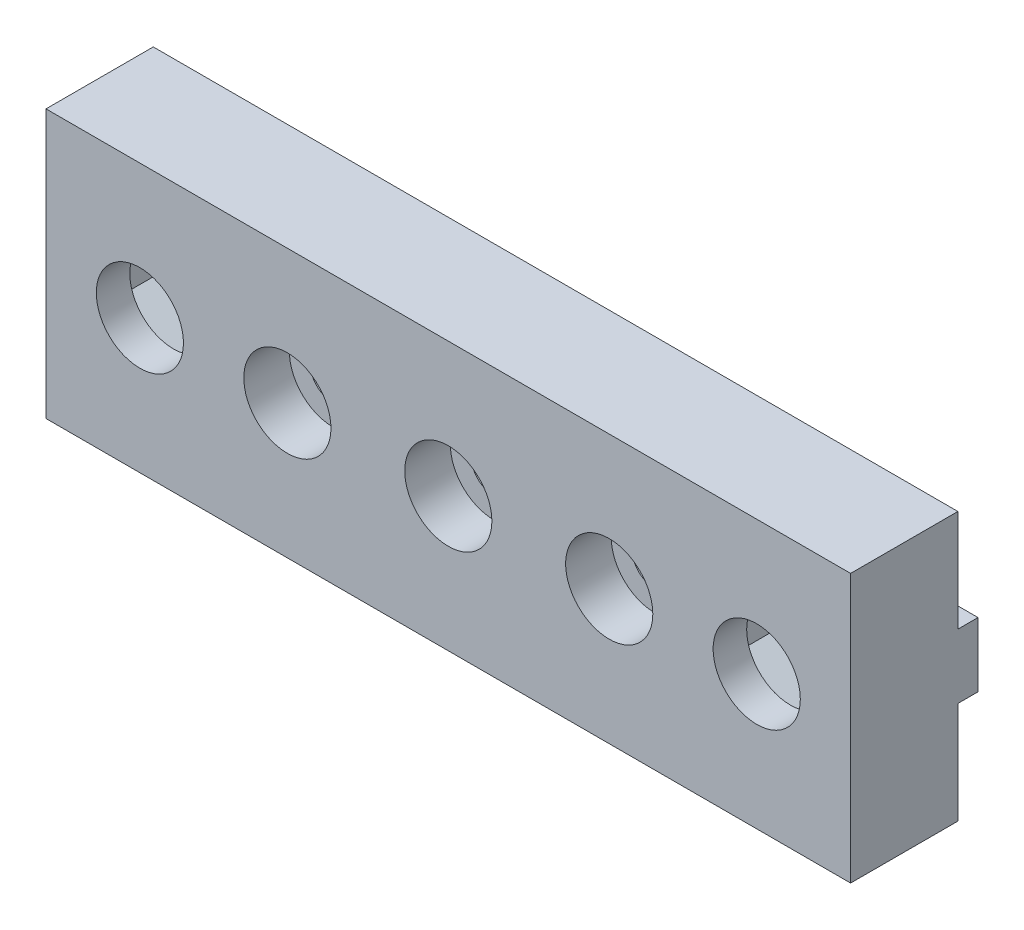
ISO-10303-21;
HEADER;
FILE_DESCRIPTION(('STEP AP214'),'2;1');
FILE_NAME('part.step','',(''),(''),'','','');
FILE_SCHEMA(('AUTOMOTIVE_DESIGN { 1 0 10303 214 1 1 1 1 }'));
ENDSEC;
DATA;
#1=APPLICATION_CONTEXT('core data for automotive mechanical design processes');
#2=APPLICATION_PROTOCOL_DEFINITION('international standard','automotive_design',2000,#1);
#3=PRODUCT_CONTEXT('',#1,'mechanical');
#4=PRODUCT('Part','Part','',(#3));
#5=PRODUCT_RELATED_PRODUCT_CATEGORY('part','',(#4));
#6=PRODUCT_DEFINITION_FORMATION('','',#4);
#7=PRODUCT_DEFINITION_CONTEXT('part definition',#1,'design');
#8=PRODUCT_DEFINITION('design','',#6,#7);
#9=PRODUCT_DEFINITION_SHAPE('','',#8);
#10=(LENGTH_UNIT() NAMED_UNIT(*) SI_UNIT(.MILLI.,.METRE.));
#11=(NAMED_UNIT(*) PLANE_ANGLE_UNIT() SI_UNIT($,.RADIAN.));
#12=(NAMED_UNIT(*) SI_UNIT($,.STERADIAN.) SOLID_ANGLE_UNIT());
#13=UNCERTAINTY_MEASURE_WITH_UNIT(LENGTH_MEASURE(1.E-05),#10,'distance_accuracy_value','');
#14=(GEOMETRIC_REPRESENTATION_CONTEXT(3) GLOBAL_UNCERTAINTY_ASSIGNED_CONTEXT((#13)) GLOBAL_UNIT_ASSIGNED_CONTEXT((#10,
#11,#12)) REPRESENTATION_CONTEXT('',''));
#15=CARTESIAN_POINT('',(0.,0.,0.));
#16=DIRECTION('',(0.,0.,1.));
#17=DIRECTION('',(1.,0.,0.));
#18=AXIS2_PLACEMENT_3D('',#15,#16,#17);
#19=CARTESIAN_POINT('',(30.,-2.4,-5.5));
#20=DIRECTION('',(0.,1.,0.));
#21=DIRECTION('',(0.,0.,1.));
#22=AXIS2_PLACEMENT_3D('',#19,#20,#21);
#23=PLANE('',#22);
#24=DIRECTION('',(0.,0.,-1.));
#25=VECTOR('',#24,1.);
#26=CARTESIAN_POINT('',(-28.1,-2.4,-5.5));
#27=LINE('',#26,#25);
#28=CARTESIAN_POINT('',(-28.1,-2.4,-4.));
#29=VERTEX_POINT('',#28);
#30=CARTESIAN_POINT('',(-28.1,-2.4,-5.5));
#31=VERTEX_POINT('',#30);
#32=EDGE_CURVE('E381',#29,#31,#27,.T.);
#33=ORIENTED_EDGE('',*,*,#32,.F.);
#34=DIRECTION('',(1.,0.,0.));
#35=VECTOR('',#34,1.);
#36=CARTESIAN_POINT('',(0.,-2.4,-4.));
#37=LINE('',#36,#35);
#38=CARTESIAN_POINT('',(-30.,-2.4,-4.));
#39=VERTEX_POINT('',#38);
#40=EDGE_CURVE('E493',#39,#29,#37,.T.);
#41=ORIENTED_EDGE('',*,*,#40,.F.);
#42=DIRECTION('',(0.,0.,1.));
#43=VECTOR('',#42,1.);
#44=CARTESIAN_POINT('',(-30.,-2.4,-5.5));
#45=LINE('',#44,#43);
#46=CARTESIAN_POINT('',(-30.,-2.4,-5.5));
#47=VERTEX_POINT('',#46);
#48=EDGE_CURVE('E430',#47,#39,#45,.T.);
#49=ORIENTED_EDGE('',*,*,#48,.F.);
#50=DIRECTION('',(-1.,0.,0.));
#51=VECTOR('',#50,1.);
#52=CARTESIAN_POINT('',(30.,-2.4,-5.5));
#53=LINE('',#52,#51);
#54=EDGE_CURVE('E425',#31,#47,#53,.T.);
#55=ORIENTED_EDGE('',*,*,#54,.F.);
#56=EDGE_LOOP('',(#33,#41,#49,#55));
#57=FACE_BOUND('',#56,.T.);
#58=ADVANCED_FACE('F45',(#57),#23,.F.);
#59=CARTESIAN_POINT('',(0.,0.,-5.5));
#60=DIRECTION('',(0.,0.,1.));
#61=DIRECTION('',(1.,0.,0.));
#62=AXIS2_PLACEMENT_3D('',#59,#60,#61);
#63=PLANE('',#62);
#64=DIRECTION('',(0.,1.,0.));
#65=VECTOR('',#64,1.);
#66=CARTESIAN_POINT('',(-28.1,-2.94448637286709,-5.5));
#67=LINE('',#66,#65);
#68=CARTESIAN_POINT('',(-28.1,2.4,-5.5));
#69=VERTEX_POINT('',#68);
#70=EDGE_CURVE('E64',#31,#69,#67,.T.);
#71=ORIENTED_EDGE('',*,*,#70,.F.);
#72=ORIENTED_EDGE('',*,*,#54,.T.);
#73=DIRECTION('',(0.,1.,0.));
#74=VECTOR('',#73,1.);
#75=CARTESIAN_POINT('',(-30.,-2.4,-5.5));
#76=LINE('',#75,#74);
#77=CARTESIAN_POINT('',(-30.,2.4,-5.5));
#78=VERTEX_POINT('',#77);
#79=EDGE_CURVE('E412',#47,#78,#76,.T.);
#80=ORIENTED_EDGE('',*,*,#79,.T.);
#81=DIRECTION('',(1.,0.,0.));
#82=VECTOR('',#81,1.);
#83=CARTESIAN_POINT('',(30.,2.4,-5.5));
#84=LINE('',#83,#82);
#85=EDGE_CURVE('E417',#78,#69,#84,.T.);
#86=ORIENTED_EDGE('',*,*,#85,.T.);
#87=EDGE_LOOP('',(#71,#72,#80,#86));
#88=FACE_BOUND('',#87,.T.);
#89=ADVANCED_FACE('F740',(#88),#63,.F.);
#90=CARTESIAN_POINT('',(30.,2.4,-5.5));
#91=DIRECTION('',(0.,-1.,0.));
#92=DIRECTION('',(0.,0.,-1.));
#93=AXIS2_PLACEMENT_3D('',#90,#91,#92);
#94=PLANE('',#93);
#95=DIRECTION('',(0.,0.,1.));
#96=VECTOR('',#95,1.);
#97=CARTESIAN_POINT('',(17.9,2.4,-5.5));
#98=LINE('',#97,#96);
#99=CARTESIAN_POINT('',(17.9,2.4,-5.5));
#100=VERTEX_POINT('',#99);
#101=CARTESIAN_POINT('',(17.9,2.4,-4.));
#102=VERTEX_POINT('',#101);
#103=EDGE_CURVE('E401',#100,#102,#98,.T.);
#104=ORIENTED_EDGE('',*,*,#103,.F.);
#105=CARTESIAN_POINT('',(-17.9,2.4,-5.5));
#106=VERTEX_POINT('',#105);
#107=EDGE_CURVE('E422',#106,#100,#84,.T.);
#108=ORIENTED_EDGE('',*,*,#107,.F.);
#109=DIRECTION('',(0.,0.,-1.));
#110=VECTOR('',#109,1.);
#111=CARTESIAN_POINT('',(-17.9,2.4,-5.5));
#112=LINE('',#111,#110);
#113=CARTESIAN_POINT('',(-17.9,2.4,-4.));
#114=VERTEX_POINT('',#113);
#115=EDGE_CURVE('E391',#114,#106,#112,.T.);
#116=ORIENTED_EDGE('',*,*,#115,.F.);
#117=DIRECTION('',(-1.,0.,0.));
#118=VECTOR('',#117,1.);
#119=CARTESIAN_POINT('',(0.,2.4,-4.));
#120=LINE('',#119,#118);
#121=EDGE_CURVE('E504',#102,#114,#120,.T.);
#122=ORIENTED_EDGE('',*,*,#121,.F.);
#123=EDGE_LOOP('',(#104,#108,#116,#122));
#124=FACE_BOUND('',#123,.T.);
#125=ADVANCED_FACE('F694',(#124),#94,.F.);
#126=DIRECTION('',(0.,0.,-1.));
#127=VECTOR('',#126,1.);
#128=CARTESIAN_POINT('',(17.9,-2.4,-5.5));
#129=LINE('',#128,#127);
#130=CARTESIAN_POINT('',(17.9,-2.4,-4.));
#131=VERTEX_POINT('',#130);
#132=CARTESIAN_POINT('',(17.9,-2.4,-5.5));
#133=VERTEX_POINT('',#132);
#134=EDGE_CURVE('E394',#131,#133,#129,.T.);
#135=ORIENTED_EDGE('',*,*,#134,.F.);
#136=CARTESIAN_POINT('',(-17.9,-2.4,-4.));
#137=VERTEX_POINT('',#136);
#138=EDGE_CURVE('E498',#137,#131,#37,.T.);
#139=ORIENTED_EDGE('',*,*,#138,.F.);
#140=DIRECTION('',(0.,0.,1.));
#141=VECTOR('',#140,1.);
#142=CARTESIAN_POINT('',(-17.9,-2.4,-5.5));
#143=LINE('',#142,#141);
#144=CARTESIAN_POINT('',(-17.9,-2.4,-5.5));
#145=VERTEX_POINT('',#144);
#146=EDGE_CURVE('E384',#145,#137,#143,.T.);
#147=ORIENTED_EDGE('',*,*,#146,.F.);
#148=EDGE_CURVE('E431',#133,#145,#53,.T.);
#149=ORIENTED_EDGE('',*,*,#148,.F.);
#150=EDGE_LOOP('',(#135,#139,#147,#149));
#151=FACE_BOUND('',#150,.T.);
#152=ADVANCED_FACE('F704',(#151),#23,.F.);
#153=CARTESIAN_POINT('',(-12.,0.,-5.5));
#154=DIRECTION('',(0.,0.,1.));
#155=DIRECTION('',(1.,0.,0.));
#156=AXIS2_PLACEMENT_3D('',#153,#154,#155);
#157=CIRCLE('',#156,1.7);
#158=CARTESIAN_POINT('',(-10.3,0.,-5.5));
#159=VERTEX_POINT('',#158);
#160=EDGE_CURVE('E1219',#159,#159,#157,.T.);
#161=ORIENTED_EDGE('',*,*,#160,.T.);
#162=EDGE_LOOP('',(#161));
#163=FACE_BOUND('',#162,.T.);
#164=CARTESIAN_POINT('',(0.,0.,-5.5));
#165=DIRECTION('',(0.,0.,1.));
#166=DIRECTION('',(1.,0.,0.));
#167=AXIS2_PLACEMENT_3D('',#164,#165,#166);
#168=CIRCLE('',#167,1.7);
#169=CARTESIAN_POINT('',(1.7,0.,-5.5));
#170=VERTEX_POINT('',#169);
#171=EDGE_CURVE('E1233',#170,#170,#168,.T.);
#172=ORIENTED_EDGE('',*,*,#171,.T.);
#173=EDGE_LOOP('',(#172));
#174=FACE_BOUND('',#173,.T.);
#175=CARTESIAN_POINT('',(12.,0.,-5.5));
#176=DIRECTION('',(0.,0.,1.));
#177=DIRECTION('',(1.,0.,0.));
#178=AXIS2_PLACEMENT_3D('',#175,#176,#177);
#179=CIRCLE('',#178,1.7);
#180=CARTESIAN_POINT('',(13.7,0.,-5.5));
#181=VERTEX_POINT('',#180);
#182=EDGE_CURVE('E282',#181,#181,#179,.T.);
#183=ORIENTED_EDGE('',*,*,#182,.T.);
#184=EDGE_LOOP('',(#183));
#185=FACE_BOUND('',#184,.T.);
#186=DIRECTION('',(0.,1.,0.));
#187=VECTOR('',#186,1.);
#188=CARTESIAN_POINT('',(17.9,-2.9444863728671,-5.5));
#189=LINE('',#188,#187);
#190=EDGE_CURVE('E299',#133,#100,#189,.T.);
#191=ORIENTED_EDGE('',*,*,#190,.F.);
#192=ORIENTED_EDGE('',*,*,#148,.T.);
#193=DIRECTION('',(0.,-1.,0.));
#194=VECTOR('',#193,1.);
#195=CARTESIAN_POINT('',(-17.9,2.94448637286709,-5.5));
#196=LINE('',#195,#194);
#197=EDGE_CURVE('E340',#106,#145,#196,.T.);
#198=ORIENTED_EDGE('',*,*,#197,.F.);
#199=ORIENTED_EDGE('',*,*,#107,.T.);
#200=EDGE_LOOP('',(#191,#192,#198,#199));
#201=FACE_BOUND('',#200,.T.);
#202=ADVANCED_FACE('F702',(#163,#174,#185,#201),#63,.F.);
#203=DIRECTION('',(0.,0.,-1.));
#204=VECTOR('',#203,1.);
#205=CARTESIAN_POINT('',(28.1,2.4,-5.5));
#206=LINE('',#205,#204);
#207=CARTESIAN_POINT('',(28.1,2.4,-4.));
#208=VERTEX_POINT('',#207);
#209=CARTESIAN_POINT('',(28.1,2.4,-5.5));
#210=VERTEX_POINT('',#209);
#211=EDGE_CURVE('E72',#208,#210,#206,.T.);
#212=ORIENTED_EDGE('',*,*,#211,.F.);
#213=CARTESIAN_POINT('',(30.,2.4,-4.));
#214=VERTEX_POINT('',#213);
#215=EDGE_CURVE('E499',#214,#208,#120,.T.);
#216=ORIENTED_EDGE('',*,*,#215,.F.);
#217=DIRECTION('',(0.,0.,1.));
#218=VECTOR('',#217,1.);
#219=CARTESIAN_POINT('',(30.,2.4,-5.5));
#220=LINE('',#219,#218);
#221=CARTESIAN_POINT('',(30.,2.4,-5.5));
#222=VERTEX_POINT('',#221);
#223=EDGE_CURVE('E439',#222,#214,#220,.T.);
#224=ORIENTED_EDGE('',*,*,#223,.F.);
#225=EDGE_CURVE('E416',#210,#222,#84,.T.);
#226=ORIENTED_EDGE('',*,*,#225,.F.);
#227=EDGE_LOOP('',(#212,#216,#224,#226));
#228=FACE_BOUND('',#227,.T.);
#229=ADVANCED_FACE('F760',(#228),#94,.F.);
#230=CARTESIAN_POINT('',(0.,0.,-4.));
#231=DIRECTION('',(0.,0.,-1.));
#232=DIRECTION('',(-1.,0.,0.));
#233=AXIS2_PLACEMENT_3D('',#230,#231,#232);
#234=PLANE('',#233);
#235=ORIENTED_EDGE('',*,*,#215,.T.);
#236=DIRECTION('',(0.,1.,0.));
#237=VECTOR('',#236,1.);
#238=CARTESIAN_POINT('',(28.1,0.,-4.));
#239=LINE('',#238,#237);
#240=CARTESIAN_POINT('',(28.1,2.9444863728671,-4.));
#241=VERTEX_POINT('',#240);
#242=EDGE_CURVE('E367',#208,#241,#239,.T.);
#243=ORIENTED_EDGE('',*,*,#242,.T.);
#244=DIRECTION('',(-0.866025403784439,0.5,0.));
#245=VECTOR('',#244,1.);
#246=CARTESIAN_POINT('',(8.29999999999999,14.3760217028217,-4.));
#247=LINE('',#246,#245);
#248=CARTESIAN_POINT('',(23.,5.88897274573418,-4.));
#249=VERTEX_POINT('',#248);
#250=EDGE_CURVE('E11',#241,#249,#247,.T.);
#251=ORIENTED_EDGE('',*,*,#250,.T.);
#252=DIRECTION('',(-0.866025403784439,-0.5,0.));
#253=VECTOR('',#252,1.);
#254=CARTESIAN_POINT('',(3.2,-5.54256258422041,-4.));
#255=LINE('',#254,#253);
#256=CARTESIAN_POINT('',(17.9,2.94448637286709,-4.));
#257=VERTEX_POINT('',#256);
#258=EDGE_CURVE('E54',#249,#257,#255,.T.);
#259=ORIENTED_EDGE('',*,*,#258,.T.);
#260=DIRECTION('',(0.,-1.,0.));
#261=VECTOR('',#260,1.);
#262=CARTESIAN_POINT('',(17.9,0.,-4.));
#263=LINE('',#262,#261);
#264=EDGE_CURVE('E397',#257,#102,#263,.T.);
#265=ORIENTED_EDGE('',*,*,#264,.T.);
#266=ORIENTED_EDGE('',*,*,#121,.T.);
#267=DIRECTION('',(0.,1.,0.));
#268=VECTOR('',#267,1.);
#269=CARTESIAN_POINT('',(-17.9,0.,-4.));
#270=LINE('',#269,#268);
#271=CARTESIAN_POINT('',(-17.9,2.94448637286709,-4.));
#272=VERTEX_POINT('',#271);
#273=EDGE_CURVE('E387',#114,#272,#270,.T.);
#274=ORIENTED_EDGE('',*,*,#273,.T.);
#275=DIRECTION('',(-0.866025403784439,0.5,0.));
#276=VECTOR('',#275,1.);
#277=CARTESIAN_POINT('',(-3.2,-5.5425625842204,-4.));
#278=LINE('',#277,#276);
#279=CARTESIAN_POINT('',(-23.,5.88897274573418,-4.));
#280=VERTEX_POINT('',#279);
#281=EDGE_CURVE('E541',#272,#280,#278,.T.);
#282=ORIENTED_EDGE('',*,*,#281,.T.);
#283=DIRECTION('',(-0.866025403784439,-0.5,0.));
#284=VECTOR('',#283,1.);
#285=CARTESIAN_POINT('',(-8.29999999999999,14.3760217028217,-4.));
#286=LINE('',#285,#284);
#287=CARTESIAN_POINT('',(-28.1,2.94448637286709,-4.));
#288=VERTEX_POINT('',#287);
#289=EDGE_CURVE('E537',#280,#288,#286,.T.);
#290=ORIENTED_EDGE('',*,*,#289,.T.);
#291=DIRECTION('',(0.,-1.,0.));
#292=VECTOR('',#291,1.);
#293=CARTESIAN_POINT('',(-28.1,0.,-4.));
#294=LINE('',#293,#292);
#295=CARTESIAN_POINT('',(-28.1,2.4,-4.));
#296=VERTEX_POINT('',#295);
#297=EDGE_CURVE('E373',#288,#296,#294,.T.);
#298=ORIENTED_EDGE('',*,*,#297,.T.);
#299=CARTESIAN_POINT('',(-30.,2.4,-4.));
#300=VERTEX_POINT('',#299);
#301=EDGE_CURVE('E497',#296,#300,#120,.T.);
#302=ORIENTED_EDGE('',*,*,#301,.T.);
#303=DIRECTION('',(0.,-1.,0.));
#304=VECTOR('',#303,1.);
#305=CARTESIAN_POINT('',(-30.,-10.,-4.));
#306=LINE('',#305,#304);
#307=CARTESIAN_POINT('',(-30.,10.,-4.));
#308=VERTEX_POINT('',#307);
#309=EDGE_CURVE('E471',#308,#300,#306,.T.);
#310=ORIENTED_EDGE('',*,*,#309,.F.);
#311=DIRECTION('',(-1.,0.,0.));
#312=VECTOR('',#311,1.);
#313=CARTESIAN_POINT('',(-30.,10.,-4.));
#314=LINE('',#313,#312);
#315=CARTESIAN_POINT('',(30.,10.,-4.));
#316=VERTEX_POINT('',#315);
#317=EDGE_CURVE('E467',#316,#308,#314,.T.);
#318=ORIENTED_EDGE('',*,*,#317,.F.);
#319=DIRECTION('',(0.,1.,0.));
#320=VECTOR('',#319,1.);
#321=CARTESIAN_POINT('',(30.,-10.,-4.));
#322=LINE('',#321,#320);
#323=EDGE_CURVE('E447',#214,#316,#322,.T.);
#324=ORIENTED_EDGE('',*,*,#323,.F.);
#325=EDGE_LOOP('',(#235,#243,#251,#259,#265,#266,#274,#282,#290,#298,#302,#310,#318,#324));
#326=FACE_BOUND('',#325,.T.);
#327=ADVANCED_FACE('F547',(#326),#234,.T.);
#328=DIRECTION('',(0.866025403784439,0.5,0.));
#329=VECTOR('',#328,1.);
#330=CARTESIAN_POINT('',(8.3,-14.3760217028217,-4.));
#331=LINE('',#330,#329);
#332=CARTESIAN_POINT('',(23.,-5.88897274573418,-4.));
#333=VERTEX_POINT('',#332);
#334=CARTESIAN_POINT('',(28.1,-2.94448637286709,-4.));
#335=VERTEX_POINT('',#334);
#336=EDGE_CURVE('E533',#333,#335,#331,.T.);
#337=ORIENTED_EDGE('',*,*,#336,.T.);
#338=DIRECTION('',(0.,1.,0.));
#339=VECTOR('',#338,1.);
#340=CARTESIAN_POINT('',(28.1,0.,-4.));
#341=LINE('',#340,#339);
#342=CARTESIAN_POINT('',(28.1,-2.4,-4.));
#343=VERTEX_POINT('',#342);
#344=EDGE_CURVE('E362',#335,#343,#341,.T.);
#345=ORIENTED_EDGE('',*,*,#344,.T.);
#346=CARTESIAN_POINT('',(30.,-2.4,-4.));
#347=VERTEX_POINT('',#346);
#348=EDGE_CURVE('E492',#343,#347,#37,.T.);
#349=ORIENTED_EDGE('',*,*,#348,.T.);
#350=CARTESIAN_POINT('',(30.,-10.,-4.));
#351=VERTEX_POINT('',#350);
#352=EDGE_CURVE('E463',#351,#347,#322,.T.);
#353=ORIENTED_EDGE('',*,*,#352,.F.);
#354=DIRECTION('',(1.,0.,0.));
#355=VECTOR('',#354,1.);
#356=CARTESIAN_POINT('',(-30.,-10.,-4.));
#357=LINE('',#356,#355);
#358=CARTESIAN_POINT('',(-30.,-10.,-4.));
#359=VERTEX_POINT('',#358);
#360=EDGE_CURVE('E453',#359,#351,#357,.T.);
#361=ORIENTED_EDGE('',*,*,#360,.F.);
#362=EDGE_CURVE('E470',#39,#359,#306,.T.);
#363=ORIENTED_EDGE('',*,*,#362,.F.);
#364=ORIENTED_EDGE('',*,*,#40,.T.);
#365=DIRECTION('',(0.,-1.,0.));
#366=VECTOR('',#365,1.);
#367=CARTESIAN_POINT('',(-28.1,0.,-4.));
#368=LINE('',#367,#366);
#369=CARTESIAN_POINT('',(-28.1,-2.94448637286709,-4.));
#370=VERTEX_POINT('',#369);
#371=EDGE_CURVE('E377',#29,#370,#368,.T.);
#372=ORIENTED_EDGE('',*,*,#371,.T.);
#373=DIRECTION('',(0.866025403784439,-0.5,0.));
#374=VECTOR('',#373,1.);
#375=CARTESIAN_POINT('',(-8.3,-14.3760217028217,-4.));
#376=LINE('',#375,#374);
#377=CARTESIAN_POINT('',(-23.,-5.88897274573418,-4.));
#378=VERTEX_POINT('',#377);
#379=EDGE_CURVE('E513',#370,#378,#376,.T.);
#380=ORIENTED_EDGE('',*,*,#379,.T.);
#381=DIRECTION('',(0.866025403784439,0.5,0.));
#382=VECTOR('',#381,1.);
#383=CARTESIAN_POINT('',(-3.2,5.5425625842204,-4.));
#384=LINE('',#383,#382);
#385=CARTESIAN_POINT('',(-17.9,-2.94448637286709,-4.));
#386=VERTEX_POINT('',#385);
#387=EDGE_CURVE('E517',#378,#386,#384,.T.);
#388=ORIENTED_EDGE('',*,*,#387,.T.);
#389=DIRECTION('',(0.,1.,0.));
#390=VECTOR('',#389,1.);
#391=CARTESIAN_POINT('',(-17.9,0.,-4.));
#392=LINE('',#391,#390);
#393=EDGE_CURVE('E521',#386,#137,#392,.T.);
#394=ORIENTED_EDGE('',*,*,#393,.T.);
#395=ORIENTED_EDGE('',*,*,#138,.T.);
#396=DIRECTION('',(0.,-1.,0.));
#397=VECTOR('',#396,1.);
#398=CARTESIAN_POINT('',(17.9,0.,-4.));
#399=LINE('',#398,#397);
#400=CARTESIAN_POINT('',(17.9,-2.9444863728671,-4.));
#401=VERTEX_POINT('',#400);
#402=EDGE_CURVE('E525',#131,#401,#399,.T.);
#403=ORIENTED_EDGE('',*,*,#402,.T.);
#404=DIRECTION('',(0.866025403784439,-0.5,0.));
#405=VECTOR('',#404,1.);
#406=CARTESIAN_POINT('',(3.2,5.5425625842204,-4.));
#407=LINE('',#406,#405);
#408=EDGE_CURVE('E529',#401,#333,#407,.T.);
#409=ORIENTED_EDGE('',*,*,#408,.T.);
#410=EDGE_LOOP('',(#337,#345,#349,#353,#361,#363,#364,#372,#380,#388,#394,#395,#403,#409));
#411=FACE_BOUND('',#410,.T.);
#412=ADVANCED_FACE('F565',(#411),#234,.T.);
#413=DIRECTION('',(0.,0.,1.));
#414=VECTOR('',#413,1.);
#415=CARTESIAN_POINT('',(-28.1,2.4,-5.5));
#416=LINE('',#415,#414);
#417=EDGE_CURVE('E503',#69,#296,#416,.T.);
#418=ORIENTED_EDGE('',*,*,#417,.F.);
#419=ORIENTED_EDGE('',*,*,#85,.F.);
#420=DIRECTION('',(0.,0.,1.));
#421=VECTOR('',#420,1.);
#422=CARTESIAN_POINT('',(-30.,2.4,-5.5));
#423=LINE('',#422,#421);
#424=EDGE_CURVE('E443',#78,#300,#423,.T.);
#425=ORIENTED_EDGE('',*,*,#424,.T.);
#426=ORIENTED_EDGE('',*,*,#301,.F.);
#427=EDGE_LOOP('',(#418,#419,#425,#426));
#428=FACE_BOUND('',#427,.T.);
#429=ADVANCED_FACE('F752',(#428),#94,.F.);
#430=DIRECTION('',(0.,0.,1.));
#431=VECTOR('',#430,1.);
#432=CARTESIAN_POINT('',(28.1,-2.4,-5.5));
#433=LINE('',#432,#431);
#434=CARTESIAN_POINT('',(28.1,-2.4,-5.5));
#435=VERTEX_POINT('',#434);
#436=EDGE_CURVE('E359',#435,#343,#433,.T.);
#437=ORIENTED_EDGE('',*,*,#436,.F.);
#438=CARTESIAN_POINT('',(30.,-2.4,-5.5));
#439=VERTEX_POINT('',#438);
#440=EDGE_CURVE('E426',#439,#435,#53,.T.);
#441=ORIENTED_EDGE('',*,*,#440,.F.);
#442=DIRECTION('',(0.,0.,1.));
#443=VECTOR('',#442,1.);
#444=CARTESIAN_POINT('',(30.,-2.4,-5.5));
#445=LINE('',#444,#443);
#446=EDGE_CURVE('E435',#439,#347,#445,.T.);
#447=ORIENTED_EDGE('',*,*,#446,.T.);
#448=ORIENTED_EDGE('',*,*,#348,.F.);
#449=EDGE_LOOP('',(#437,#441,#447,#448));
#450=FACE_BOUND('',#449,.T.);
#451=ADVANCED_FACE('F580',(#450),#23,.F.);
#452=DIRECTION('',(0.,-1.,0.));
#453=VECTOR('',#452,1.);
#454=CARTESIAN_POINT('',(28.1,2.9444863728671,-5.5));
#455=LINE('',#454,#453);
#456=EDGE_CURVE('E296',#210,#435,#455,.T.);
#457=ORIENTED_EDGE('',*,*,#456,.F.);
#458=ORIENTED_EDGE('',*,*,#225,.T.);
#459=DIRECTION('',(0.,-1.,0.));
#460=VECTOR('',#459,1.);
#461=CARTESIAN_POINT('',(30.,-2.4,-5.5));
#462=LINE('',#461,#460);
#463=EDGE_CURVE('E421',#222,#439,#462,.T.);
#464=ORIENTED_EDGE('',*,*,#463,.T.);
#465=ORIENTED_EDGE('',*,*,#440,.T.);
#466=EDGE_LOOP('',(#457,#458,#464,#465));
#467=FACE_BOUND('',#466,.T.);
#468=ADVANCED_FACE('F748',(#467),#63,.F.);
#469=CARTESIAN_POINT('',(23.,0.,4.));
#470=DIRECTION('',(0.,0.,1.));
#471=DIRECTION('',(1.,0.,0.));
#472=AXIS2_PLACEMENT_3D('',#469,#470,#471);
#473=CYLINDRICAL_SURFACE('',#472,3.25);
#474=CARTESIAN_POINT('',(23.,0.,4.));
#475=DIRECTION('',(0.,0.,1.));
#476=DIRECTION('',(1.,0.,0.));
#477=AXIS2_PLACEMENT_3D('',#474,#475,#476);
#478=CIRCLE('',#477,3.25);
#479=CARTESIAN_POINT('',(26.25,0.,4.));
#480=VERTEX_POINT('',#479);
#481=EDGE_CURVE('E408',#480,#480,#478,.T.);
#482=ORIENTED_EDGE('',*,*,#481,.T.);
#483=EDGE_LOOP('',(#482));
#484=FACE_BOUND('',#483,.T.);
#485=CARTESIAN_POINT('',(23.,0.,1.5));
#486=DIRECTION('',(0.,0.,-1.));
#487=DIRECTION('',(-1.,0.,0.));
#488=AXIS2_PLACEMENT_3D('',#485,#486,#487);
#489=CIRCLE('',#488,3.25);
#490=CARTESIAN_POINT('',(19.75,0.,1.5));
#491=VERTEX_POINT('',#490);
#492=EDGE_CURVE('E363',#491,#491,#489,.F.);
#493=ORIENTED_EDGE('',*,*,#492,.F.);
#494=EDGE_LOOP('',(#493));
#495=FACE_BOUND('',#494,.T.);
#496=ADVANCED_FACE('F757',(#484,#495),#473,.F.);
#497=CARTESIAN_POINT('',(-23.,0.,4.));
#498=DIRECTION('',(0.,0.,1.));
#499=DIRECTION('',(1.,0.,0.));
#500=AXIS2_PLACEMENT_3D('',#497,#498,#499);
#501=CYLINDRICAL_SURFACE('',#500,3.25);
#502=CARTESIAN_POINT('',(-23.,0.,4.));
#503=DIRECTION('',(0.,0.,1.));
#504=DIRECTION('',(1.,0.,0.));
#505=AXIS2_PLACEMENT_3D('',#502,#503,#504);
#506=CIRCLE('',#505,3.25);
#507=CARTESIAN_POINT('',(-19.75,0.,4.));
#508=VERTEX_POINT('',#507);
#509=EDGE_CURVE('E404',#508,#508,#506,.T.);
#510=ORIENTED_EDGE('',*,*,#509,.T.);
#511=EDGE_LOOP('',(#510));
#512=FACE_BOUND('',#511,.T.);
#513=CARTESIAN_POINT('',(-23.,0.,1.5));
#514=DIRECTION('',(0.,0.,-1.));
#515=DIRECTION('',(-1.,0.,0.));
#516=AXIS2_PLACEMENT_3D('',#513,#514,#515);
#517=CIRCLE('',#516,3.25);
#518=CARTESIAN_POINT('',(-26.25,0.,1.5));
#519=VERTEX_POINT('',#518);
#520=EDGE_CURVE('E256',#519,#519,#517,.F.);
#521=ORIENTED_EDGE('',*,*,#520,.F.);
#522=EDGE_LOOP('',(#521));
#523=FACE_BOUND('',#522,.T.);
#524=ADVANCED_FACE('F818',(#512,#523),#501,.F.);
#525=CARTESIAN_POINT('',(30.,-10.,4.));
#526=DIRECTION('',(-1.,0.,0.));
#527=DIRECTION('',(0.,0.,1.));
#528=AXIS2_PLACEMENT_3D('',#525,#526,#527);
#529=PLANE('',#528);
#530=ORIENTED_EDGE('',*,*,#352,.T.);
#531=ORIENTED_EDGE('',*,*,#446,.F.);
#532=ORIENTED_EDGE('',*,*,#463,.F.);
#533=ORIENTED_EDGE('',*,*,#223,.T.);
#534=ORIENTED_EDGE('',*,*,#323,.T.);
#535=DIRECTION('',(0.,0.,-1.));
#536=VECTOR('',#535,1.);
#537=CARTESIAN_POINT('',(30.,10.,4.));
#538=LINE('',#537,#536);
#539=CARTESIAN_POINT('',(30.,10.,4.));
#540=VERTEX_POINT('',#539);
#541=EDGE_CURVE('E488',#540,#316,#538,.T.);
#542=ORIENTED_EDGE('',*,*,#541,.F.);
#543=DIRECTION('',(0.,1.,0.));
#544=VECTOR('',#543,1.);
#545=CARTESIAN_POINT('',(30.,-10.,4.));
#546=LINE('',#545,#544);
#547=CARTESIAN_POINT('',(30.,-10.,4.));
#548=VERTEX_POINT('',#547);
#549=EDGE_CURVE('E448',#548,#540,#546,.T.);
#550=ORIENTED_EDGE('',*,*,#549,.F.);
#551=DIRECTION('',(0.,0.,-1.));
#552=VECTOR('',#551,1.);
#553=CARTESIAN_POINT('',(30.,-10.,4.));
#554=LINE('',#553,#552);
#555=EDGE_CURVE('E462',#548,#351,#554,.T.);
#556=ORIENTED_EDGE('',*,*,#555,.T.);
#557=EDGE_LOOP('',(#530,#531,#532,#533,#534,#542,#550,#556));
#558=FACE_BOUND('',#557,.T.);
#559=ADVANCED_FACE('F47',(#558),#529,.F.);
#560=CARTESIAN_POINT('',(-30.,10.,4.));
#561=DIRECTION('',(0.,-1.,0.));
#562=DIRECTION('',(0.,0.,-1.));
#563=AXIS2_PLACEMENT_3D('',#560,#561,#562);
#564=PLANE('',#563);
#565=ORIENTED_EDGE('',*,*,#317,.T.);
#566=DIRECTION('',(0.,0.,-1.));
#567=VECTOR('',#566,1.);
#568=CARTESIAN_POINT('',(-30.,10.,4.));
#569=LINE('',#568,#567);
#570=CARTESIAN_POINT('',(-30.,10.,4.));
#571=VERTEX_POINT('',#570);
#572=EDGE_CURVE('E484',#571,#308,#569,.T.);
#573=ORIENTED_EDGE('',*,*,#572,.F.);
#574=DIRECTION('',(-1.,0.,0.));
#575=VECTOR('',#574,1.);
#576=CARTESIAN_POINT('',(-30.,10.,4.));
#577=LINE('',#576,#575);
#578=EDGE_CURVE('E452',#540,#571,#577,.T.);
#579=ORIENTED_EDGE('',*,*,#578,.F.);
#580=ORIENTED_EDGE('',*,*,#541,.T.);
#581=EDGE_LOOP('',(#565,#573,#579,#580));
#582=FACE_BOUND('',#581,.T.);
#583=ADVANCED_FACE('F780',(#582),#564,.F.);
#584=CARTESIAN_POINT('',(-30.,-10.,4.));
#585=DIRECTION('',(1.,0.,0.));
#586=DIRECTION('',(0.,0.,-1.));
#587=AXIS2_PLACEMENT_3D('',#584,#585,#586);
#588=PLANE('',#587);
#589=ORIENTED_EDGE('',*,*,#309,.T.);
#590=ORIENTED_EDGE('',*,*,#424,.F.);
#591=ORIENTED_EDGE('',*,*,#79,.F.);
#592=ORIENTED_EDGE('',*,*,#48,.T.);
#593=ORIENTED_EDGE('',*,*,#362,.T.);
#594=DIRECTION('',(0.,0.,-1.));
#595=VECTOR('',#594,1.);
#596=CARTESIAN_POINT('',(-30.,-10.,4.));
#597=LINE('',#596,#595);
#598=CARTESIAN_POINT('',(-30.,-10.,4.));
#599=VERTEX_POINT('',#598);
#600=EDGE_CURVE('E480',#599,#359,#597,.T.);
#601=ORIENTED_EDGE('',*,*,#600,.F.);
#602=DIRECTION('',(0.,-1.,0.));
#603=VECTOR('',#602,1.);
#604=CARTESIAN_POINT('',(-30.,-10.,4.));
#605=LINE('',#604,#603);
#606=EDGE_CURVE('E456',#571,#599,#605,.T.);
#607=ORIENTED_EDGE('',*,*,#606,.F.);
#608=ORIENTED_EDGE('',*,*,#572,.T.);
#609=EDGE_LOOP('',(#589,#590,#591,#592,#593,#601,#607,#608));
#610=FACE_BOUND('',#609,.T.);
#611=ADVANCED_FACE('F785',(#610),#588,.F.);
#612=CARTESIAN_POINT('',(-30.,-10.,4.));
#613=DIRECTION('',(0.,1.,0.));
#614=DIRECTION('',(0.,0.,1.));
#615=AXIS2_PLACEMENT_3D('',#612,#613,#614);
#616=PLANE('',#615);
#617=ORIENTED_EDGE('',*,*,#360,.T.);
#618=ORIENTED_EDGE('',*,*,#555,.F.);
#619=DIRECTION('',(1.,0.,0.));
#620=VECTOR('',#619,1.);
#621=CARTESIAN_POINT('',(-30.,-10.,4.));
#622=LINE('',#621,#620);
#623=EDGE_CURVE('E459',#599,#548,#622,.T.);
#624=ORIENTED_EDGE('',*,*,#623,.F.);
#625=ORIENTED_EDGE('',*,*,#600,.T.);
#626=EDGE_LOOP('',(#617,#618,#624,#625));
#627=FACE_BOUND('',#626,.T.);
#628=ADVANCED_FACE('F588',(#627),#616,.F.);
#629=CARTESIAN_POINT('',(0.,0.,4.));
#630=DIRECTION('',(0.,0.,-1.));
#631=DIRECTION('',(-1.,0.,0.));
#632=AXIS2_PLACEMENT_3D('',#629,#630,#631);
#633=PLANE('',#632);
#634=CARTESIAN_POINT('',(-12.,0.,4.));
#635=DIRECTION('',(0.,0.,1.));
#636=DIRECTION('',(1.,0.,0.));
#637=AXIS2_PLACEMENT_3D('',#634,#635,#636);
#638=CIRCLE('',#637,3.25);
#639=CARTESIAN_POINT('',(-8.75,0.,4.));
#640=VERTEX_POINT('',#639);
#641=EDGE_CURVE('E803',#640,#640,#638,.T.);
#642=ORIENTED_EDGE('',*,*,#641,.F.);
#643=EDGE_LOOP('',(#642));
#644=FACE_BOUND('',#643,.T.);
#645=CARTESIAN_POINT('',(0.,0.,4.));
#646=DIRECTION('',(0.,0.,1.));
#647=DIRECTION('',(1.,0.,0.));
#648=AXIS2_PLACEMENT_3D('',#645,#646,#647);
#649=CIRCLE('',#648,3.25);
#650=CARTESIAN_POINT('',(3.25,0.,4.));
#651=VERTEX_POINT('',#650);
#652=EDGE_CURVE('E807',#651,#651,#649,.T.);
#653=ORIENTED_EDGE('',*,*,#652,.F.);
#654=EDGE_LOOP('',(#653));
#655=FACE_BOUND('',#654,.T.);
#656=CARTESIAN_POINT('',(12.,0.,4.));
#657=DIRECTION('',(0.,0.,1.));
#658=DIRECTION('',(1.,0.,0.));
#659=AXIS2_PLACEMENT_3D('',#656,#657,#658);
#660=CIRCLE('',#659,3.25);
#661=CARTESIAN_POINT('',(15.25,0.,4.));
#662=VERTEX_POINT('',#661);
#663=EDGE_CURVE('E811',#662,#662,#660,.T.);
#664=ORIENTED_EDGE('',*,*,#663,.F.);
#665=EDGE_LOOP('',(#664));
#666=FACE_BOUND('',#665,.T.);
#667=ORIENTED_EDGE('',*,*,#509,.F.);
#668=EDGE_LOOP('',(#667));
#669=FACE_BOUND('',#668,.T.);
#670=ORIENTED_EDGE('',*,*,#481,.F.);
#671=EDGE_LOOP('',(#670));
#672=FACE_BOUND('',#671,.T.);
#673=ORIENTED_EDGE('',*,*,#549,.T.);
#674=ORIENTED_EDGE('',*,*,#578,.T.);
#675=ORIENTED_EDGE('',*,*,#606,.T.);
#676=ORIENTED_EDGE('',*,*,#623,.T.);
#677=EDGE_LOOP('',(#673,#674,#675,#676));
#678=FACE_BOUND('',#677,.T.);
#679=ADVANCED_FACE('F784',(#644,#655,#666,#669,#672,#678),#633,.F.);
#680=CARTESIAN_POINT('',(-17.9,2.94448637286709,-5.5));
#681=DIRECTION('',(-1.,0.,0.));
#682=DIRECTION('',(0.,0.,1.));
#683=AXIS2_PLACEMENT_3D('',#680,#681,#682);
#684=PLANE('',#683);
#685=ORIENTED_EDGE('',*,*,#115,.T.);
#686=ORIENTED_EDGE('',*,*,#197,.T.);
#687=ORIENTED_EDGE('',*,*,#146,.T.);
#688=ORIENTED_EDGE('',*,*,#393,.F.);
#689=DIRECTION('',(0.,0.,1.));
#690=VECTOR('',#689,1.);
#691=CARTESIAN_POINT('',(-17.9,-2.94448637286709,-5.5));
#692=LINE('',#691,#690);
#693=CARTESIAN_POINT('',(-17.9,-2.94448637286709,1.5));
#694=VERTEX_POINT('',#693);
#695=EDGE_CURVE('E354',#386,#694,#692,.T.);
#696=ORIENTED_EDGE('',*,*,#695,.T.);
#697=DIRECTION('',(0.,-1.,0.));
#698=VECTOR('',#697,1.);
#699=CARTESIAN_POINT('',(-17.9,2.94448637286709,1.5));
#700=LINE('',#699,#698);
#701=CARTESIAN_POINT('',(-17.9,2.94448637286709,1.5));
#702=VERTEX_POINT('',#701);
#703=EDGE_CURVE('E324',#702,#694,#700,.T.);
#704=ORIENTED_EDGE('',*,*,#703,.F.);
#705=DIRECTION('',(0.,0.,1.));
#706=VECTOR('',#705,1.);
#707=CARTESIAN_POINT('',(-17.9,2.94448637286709,-5.5));
#708=LINE('',#707,#706);
#709=EDGE_CURVE('E279',#272,#702,#708,.T.);
#710=ORIENTED_EDGE('',*,*,#709,.F.);
#711=ORIENTED_EDGE('',*,*,#273,.F.);
#712=EDGE_LOOP('',(#685,#686,#687,#688,#696,#704,#710,#711));
#713=FACE_BOUND('',#712,.T.);
#714=ADVANCED_FACE('F698',(#713),#684,.T.);
#715=CARTESIAN_POINT('',(-28.1,-2.94448637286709,-5.5));
#716=DIRECTION('',(1.,0.,0.));
#717=DIRECTION('',(0.,0.,-1.));
#718=AXIS2_PLACEMENT_3D('',#715,#716,#717);
#719=PLANE('',#718);
#720=ORIENTED_EDGE('',*,*,#32,.T.);
#721=ORIENTED_EDGE('',*,*,#70,.T.);
#722=ORIENTED_EDGE('',*,*,#417,.T.);
#723=ORIENTED_EDGE('',*,*,#297,.F.);
#724=DIRECTION('',(0.,0.,1.));
#725=VECTOR('',#724,1.);
#726=CARTESIAN_POINT('',(-28.1,2.94448637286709,-5.5));
#727=LINE('',#726,#725);
#728=CARTESIAN_POINT('',(-28.1,2.94448637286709,1.5));
#729=VERTEX_POINT('',#728);
#730=EDGE_CURVE('E345',#288,#729,#727,.T.);
#731=ORIENTED_EDGE('',*,*,#730,.T.);
#732=DIRECTION('',(0.,1.,0.));
#733=VECTOR('',#732,1.);
#734=CARTESIAN_POINT('',(-28.1,-2.94448637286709,1.5));
#735=LINE('',#734,#733);
#736=CARTESIAN_POINT('',(-28.1,-2.94448637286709,1.5));
#737=VERTEX_POINT('',#736);
#738=EDGE_CURVE('E336',#737,#729,#735,.T.);
#739=ORIENTED_EDGE('',*,*,#738,.F.);
#740=DIRECTION('',(0.,0.,1.));
#741=VECTOR('',#740,1.);
#742=CARTESIAN_POINT('',(-28.1,-2.94448637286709,-5.5));
#743=LINE('',#742,#741);
#744=EDGE_CURVE('E348',#370,#737,#743,.T.);
#745=ORIENTED_EDGE('',*,*,#744,.F.);
#746=ORIENTED_EDGE('',*,*,#371,.F.);
#747=EDGE_LOOP('',(#720,#721,#722,#723,#731,#739,#745,#746));
#748=FACE_BOUND('',#747,.T.);
#749=ADVANCED_FACE('F716',(#748),#719,.T.);
#750=CARTESIAN_POINT('',(0.,0.,1.5));
#751=DIRECTION('',(0.,0.,-1.));
#752=DIRECTION('',(-1.,0.,0.));
#753=AXIS2_PLACEMENT_3D('',#750,#751,#752);
#754=PLANE('',#753);
#755=DIRECTION('',(0.866025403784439,0.5,0.));
#756=VECTOR('',#755,1.);
#757=CARTESIAN_POINT('',(-28.1,2.94448637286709,1.5));
#758=LINE('',#757,#756);
#759=CARTESIAN_POINT('',(-23.,5.88897274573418,1.5));
#760=VERTEX_POINT('',#759);
#761=EDGE_CURVE('E316',#729,#760,#758,.T.);
#762=ORIENTED_EDGE('',*,*,#761,.T.);
#763=DIRECTION('',(0.866025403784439,-0.5,0.));
#764=VECTOR('',#763,1.);
#765=CARTESIAN_POINT('',(-23.,5.88897274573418,1.5));
#766=LINE('',#765,#764);
#767=EDGE_CURVE('E320',#760,#702,#766,.T.);
#768=ORIENTED_EDGE('',*,*,#767,.T.);
#769=ORIENTED_EDGE('',*,*,#703,.T.);
#770=DIRECTION('',(-0.866025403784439,-0.5,0.));
#771=VECTOR('',#770,1.);
#772=CARTESIAN_POINT('',(-17.9,-2.94448637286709,1.5));
#773=LINE('',#772,#771);
#774=CARTESIAN_POINT('',(-23.,-5.88897274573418,1.5));
#775=VERTEX_POINT('',#774);
#776=EDGE_CURVE('E328',#694,#775,#773,.T.);
#777=ORIENTED_EDGE('',*,*,#776,.T.);
#778=DIRECTION('',(-0.866025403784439,0.5,0.));
#779=VECTOR('',#778,1.);
#780=CARTESIAN_POINT('',(-23.,-5.88897274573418,1.5));
#781=LINE('',#780,#779);
#782=EDGE_CURVE('E332',#775,#737,#781,.T.);
#783=ORIENTED_EDGE('',*,*,#782,.T.);
#784=ORIENTED_EDGE('',*,*,#738,.T.);
#785=EDGE_LOOP('',(#762,#768,#769,#777,#783,#784));
#786=FACE_BOUND('',#785,.T.);
#787=ORIENTED_EDGE('',*,*,#520,.T.);
#788=EDGE_LOOP('',(#787));
#789=FACE_BOUND('',#788,.T.);
#790=ADVANCED_FACE('F721',(#786,#789),#754,.T.);
#791=CARTESIAN_POINT('',(-28.1,2.94448637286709,-5.5));
#792=DIRECTION('',(0.5,-0.866025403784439,0.));
#793=DIRECTION('',(0.866025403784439,0.5,0.));
#794=AXIS2_PLACEMENT_3D('',#791,#792,#793);
#795=PLANE('',#794);
#796=DIRECTION('',(0.,0.,1.));
#797=VECTOR('',#796,1.);
#798=CARTESIAN_POINT('',(-23.,5.88897274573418,-5.5));
#799=LINE('',#798,#797);
#800=EDGE_CURVE('E275',#280,#760,#799,.T.);
#801=ORIENTED_EDGE('',*,*,#800,.T.);
#802=ORIENTED_EDGE('',*,*,#761,.F.);
#803=ORIENTED_EDGE('',*,*,#730,.F.);
#804=ORIENTED_EDGE('',*,*,#289,.F.);
#805=EDGE_LOOP('',(#801,#802,#803,#804));
#806=FACE_BOUND('',#805,.T.);
#807=ADVANCED_FACE('F729',(#806),#795,.T.);
#808=CARTESIAN_POINT('',(-23.,5.88897274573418,-5.5));
#809=DIRECTION('',(-0.5,-0.866025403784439,0.));
#810=DIRECTION('',(0.866025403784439,-0.5,0.));
#811=AXIS2_PLACEMENT_3D('',#808,#809,#810);
#812=PLANE('',#811);
#813=ORIENTED_EDGE('',*,*,#709,.T.);
#814=ORIENTED_EDGE('',*,*,#767,.F.);
#815=ORIENTED_EDGE('',*,*,#800,.F.);
#816=ORIENTED_EDGE('',*,*,#281,.F.);
#817=EDGE_LOOP('',(#813,#814,#815,#816));
#818=FACE_BOUND('',#817,.T.);
#819=ADVANCED_FACE('F725',(#818),#812,.T.);
#820=CARTESIAN_POINT('',(-17.9,-2.94448637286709,-5.5));
#821=DIRECTION('',(-0.5,0.866025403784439,0.));
#822=DIRECTION('',(-0.866025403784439,-0.5,0.));
#823=AXIS2_PLACEMENT_3D('',#820,#821,#822);
#824=PLANE('',#823);
#825=DIRECTION('',(0.,0.,1.));
#826=VECTOR('',#825,1.);
#827=CARTESIAN_POINT('',(-23.,-5.88897274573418,-5.5));
#828=LINE('',#827,#826);
#829=EDGE_CURVE('E351',#378,#775,#828,.T.);
#830=ORIENTED_EDGE('',*,*,#829,.T.);
#831=ORIENTED_EDGE('',*,*,#776,.F.);
#832=ORIENTED_EDGE('',*,*,#695,.F.);
#833=ORIENTED_EDGE('',*,*,#387,.F.);
#834=EDGE_LOOP('',(#830,#831,#832,#833));
#835=FACE_BOUND('',#834,.T.);
#836=ADVANCED_FACE('F709',(#835),#824,.T.);
#837=CARTESIAN_POINT('',(-23.,-5.88897274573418,-5.5));
#838=DIRECTION('',(0.5,0.866025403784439,0.));
#839=DIRECTION('',(-0.866025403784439,0.5,0.));
#840=AXIS2_PLACEMENT_3D('',#837,#838,#839);
#841=PLANE('',#840);
#842=ORIENTED_EDGE('',*,*,#744,.T.);
#843=ORIENTED_EDGE('',*,*,#782,.F.);
#844=ORIENTED_EDGE('',*,*,#829,.F.);
#845=ORIENTED_EDGE('',*,*,#379,.F.);
#846=EDGE_LOOP('',(#842,#843,#844,#845));
#847=FACE_BOUND('',#846,.T.);
#848=ADVANCED_FACE('F713',(#847),#841,.T.);
#849=CARTESIAN_POINT('',(17.9,-2.9444863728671,-5.5));
#850=DIRECTION('',(1.,0.,0.));
#851=DIRECTION('',(0.,0.,-1.));
#852=AXIS2_PLACEMENT_3D('',#849,#850,#851);
#853=PLANE('',#852);
#854=ORIENTED_EDGE('',*,*,#103,.T.);
#855=ORIENTED_EDGE('',*,*,#264,.F.);
#856=DIRECTION('',(0.,0.,1.));
#857=VECTOR('',#856,1.);
#858=CARTESIAN_POINT('',(17.9,2.94448637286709,-5.5));
#859=LINE('',#858,#857);
#860=CARTESIAN_POINT('',(17.9,2.94448637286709,1.5));
#861=VERTEX_POINT('',#860);
#862=EDGE_CURVE('E302',#257,#861,#859,.T.);
#863=ORIENTED_EDGE('',*,*,#862,.T.);
#864=DIRECTION('',(0.,1.,0.));
#865=VECTOR('',#864,1.);
#866=CARTESIAN_POINT('',(17.9,-2.9444863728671,1.5));
#867=LINE('',#866,#865);
#868=CARTESIAN_POINT('',(17.9,-2.9444863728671,1.5));
#869=VERTEX_POINT('',#868);
#870=EDGE_CURVE('E273',#869,#861,#867,.T.);
#871=ORIENTED_EDGE('',*,*,#870,.F.);
#872=DIRECTION('',(0.,0.,1.));
#873=VECTOR('',#872,1.);
#874=CARTESIAN_POINT('',(17.9,-2.9444863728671,-5.5));
#875=LINE('',#874,#873);
#876=EDGE_CURVE('E305',#401,#869,#875,.T.);
#877=ORIENTED_EDGE('',*,*,#876,.F.);
#878=ORIENTED_EDGE('',*,*,#402,.F.);
#879=ORIENTED_EDGE('',*,*,#134,.T.);
#880=ORIENTED_EDGE('',*,*,#190,.T.);
#881=EDGE_LOOP('',(#854,#855,#863,#871,#877,#878,#879,#880));
#882=FACE_BOUND('',#881,.T.);
#883=ADVANCED_FACE('F561',(#882),#853,.T.);
#884=CARTESIAN_POINT('',(28.1,2.9444863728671,-5.5));
#885=DIRECTION('',(-1.,0.,0.));
#886=DIRECTION('',(0.,0.,1.));
#887=AXIS2_PLACEMENT_3D('',#884,#885,#886);
#888=PLANE('',#887);
#889=ORIENTED_EDGE('',*,*,#211,.T.);
#890=ORIENTED_EDGE('',*,*,#456,.T.);
#891=ORIENTED_EDGE('',*,*,#436,.T.);
#892=ORIENTED_EDGE('',*,*,#344,.F.);
#893=DIRECTION('',(0.,0.,1.));
#894=VECTOR('',#893,1.);
#895=CARTESIAN_POINT('',(28.1,-2.94448637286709,-5.5));
#896=LINE('',#895,#894);
#897=CARTESIAN_POINT('',(28.1,-2.94448637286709,1.5));
#898=VERTEX_POINT('',#897);
#899=EDGE_CURVE('E311',#335,#898,#896,.T.);
#900=ORIENTED_EDGE('',*,*,#899,.T.);
#901=DIRECTION('',(0.,-1.,0.));
#902=VECTOR('',#901,1.);
#903=CARTESIAN_POINT('',(28.1,2.9444863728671,1.5));
#904=LINE('',#903,#902);
#905=CARTESIAN_POINT('',(28.1,2.9444863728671,1.5));
#906=VERTEX_POINT('',#905);
#907=EDGE_CURVE('E267',#906,#898,#904,.T.);
#908=ORIENTED_EDGE('',*,*,#907,.F.);
#909=DIRECTION('',(0.,0.,1.));
#910=VECTOR('',#909,1.);
#911=CARTESIAN_POINT('',(28.1,2.9444863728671,-5.5));
#912=LINE('',#911,#910);
#913=EDGE_CURVE('E257',#241,#906,#912,.T.);
#914=ORIENTED_EDGE('',*,*,#913,.F.);
#915=ORIENTED_EDGE('',*,*,#242,.F.);
#916=EDGE_LOOP('',(#889,#890,#891,#892,#900,#908,#914,#915));
#917=FACE_BOUND('',#916,.T.);
#918=ADVANCED_FACE('F550',(#917),#888,.T.);
#919=CARTESIAN_POINT('',(0.,0.,1.5));
#920=DIRECTION('',(0.,0.,-1.));
#921=DIRECTION('',(-1.,0.,0.));
#922=AXIS2_PLACEMENT_3D('',#919,#920,#921);
#923=PLANE('',#922);
#924=DIRECTION('',(0.866025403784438,0.5,0.));
#925=VECTOR('',#924,1.);
#926=CARTESIAN_POINT('',(17.9,2.94448637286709,1.5));
#927=LINE('',#926,#925);
#928=CARTESIAN_POINT('',(23.,5.88897274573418,1.5));
#929=VERTEX_POINT('',#928);
#930=EDGE_CURVE('E251',#861,#929,#927,.T.);
#931=ORIENTED_EDGE('',*,*,#930,.T.);
#932=DIRECTION('',(0.866025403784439,-0.5,0.));
#933=VECTOR('',#932,1.);
#934=CARTESIAN_POINT('',(23.,5.88897274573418,1.5));
#935=LINE('',#934,#933);
#936=EDGE_CURVE('E260',#929,#906,#935,.T.);
#937=ORIENTED_EDGE('',*,*,#936,.T.);
#938=ORIENTED_EDGE('',*,*,#907,.T.);
#939=DIRECTION('',(-0.866025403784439,-0.5,0.));
#940=VECTOR('',#939,1.);
#941=CARTESIAN_POINT('',(28.1,-2.94448637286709,1.5));
#942=LINE('',#941,#940);
#943=CARTESIAN_POINT('',(23.,-5.88897274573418,1.5));
#944=VERTEX_POINT('',#943);
#945=EDGE_CURVE('E287',#898,#944,#942,.T.);
#946=ORIENTED_EDGE('',*,*,#945,.T.);
#947=DIRECTION('',(-0.866025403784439,0.5,0.));
#948=VECTOR('',#947,1.);
#949=CARTESIAN_POINT('',(23.,-5.88897274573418,1.5));
#950=LINE('',#949,#948);
#951=EDGE_CURVE('E291',#944,#869,#950,.T.);
#952=ORIENTED_EDGE('',*,*,#951,.T.);
#953=ORIENTED_EDGE('',*,*,#870,.T.);
#954=EDGE_LOOP('',(#931,#937,#938,#946,#952,#953));
#955=FACE_BOUND('',#954,.T.);
#956=ORIENTED_EDGE('',*,*,#492,.T.);
#957=EDGE_LOOP('',(#956));
#958=FACE_BOUND('',#957,.T.);
#959=ADVANCED_FACE('F269',(#955,#958),#923,.T.);
#960=CARTESIAN_POINT('',(17.9,2.94448637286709,-5.5));
#961=DIRECTION('',(0.5,-0.866025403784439,0.));
#962=DIRECTION('',(0.866025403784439,0.5,0.));
#963=AXIS2_PLACEMENT_3D('',#960,#961,#962);
#964=PLANE('',#963);
#965=DIRECTION('',(0.,0.,1.));
#966=VECTOR('',#965,1.);
#967=CARTESIAN_POINT('',(23.,5.88897274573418,-5.5));
#968=LINE('',#967,#966);
#969=EDGE_CURVE('E246',#249,#929,#968,.T.);
#970=ORIENTED_EDGE('',*,*,#969,.T.);
#971=ORIENTED_EDGE('',*,*,#930,.F.);
#972=ORIENTED_EDGE('',*,*,#862,.F.);
#973=ORIENTED_EDGE('',*,*,#258,.F.);
#974=EDGE_LOOP('',(#970,#971,#972,#973));
#975=FACE_BOUND('',#974,.T.);
#976=ADVANCED_FACE('F248',(#975),#964,.T.);
#977=CARTESIAN_POINT('',(23.,5.88897274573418,-5.5));
#978=DIRECTION('',(-0.5,-0.866025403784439,0.));
#979=DIRECTION('',(0.866025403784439,-0.5,0.));
#980=AXIS2_PLACEMENT_3D('',#977,#978,#979);
#981=PLANE('',#980);
#982=ORIENTED_EDGE('',*,*,#913,.T.);
#983=ORIENTED_EDGE('',*,*,#936,.F.);
#984=ORIENTED_EDGE('',*,*,#969,.F.);
#985=ORIENTED_EDGE('',*,*,#250,.F.);
#986=EDGE_LOOP('',(#982,#983,#984,#985));
#987=FACE_BOUND('',#986,.T.);
#988=ADVANCED_FACE('F261',(#987),#981,.T.);
#989=CARTESIAN_POINT('',(28.1,-2.94448637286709,-5.5));
#990=DIRECTION('',(-0.5,0.866025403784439,0.));
#991=DIRECTION('',(-0.866025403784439,-0.5,0.));
#992=AXIS2_PLACEMENT_3D('',#989,#990,#991);
#993=PLANE('',#992);
#994=DIRECTION('',(0.,0.,1.));
#995=VECTOR('',#994,1.);
#996=CARTESIAN_POINT('',(23.,-5.88897274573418,-5.5));
#997=LINE('',#996,#995);
#998=EDGE_CURVE('E308',#333,#944,#997,.T.);
#999=ORIENTED_EDGE('',*,*,#998,.T.);
#1000=ORIENTED_EDGE('',*,*,#945,.F.);
#1001=ORIENTED_EDGE('',*,*,#899,.F.);
#1002=ORIENTED_EDGE('',*,*,#336,.F.);
#1003=EDGE_LOOP('',(#999,#1000,#1001,#1002));
#1004=FACE_BOUND('',#1003,.T.);
#1005=ADVANCED_FACE('F555',(#1004),#993,.T.);
#1006=CARTESIAN_POINT('',(23.,-5.88897274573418,-5.5));
#1007=DIRECTION('',(0.5,0.866025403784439,0.));
#1008=DIRECTION('',(-0.866025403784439,0.5,0.));
#1009=AXIS2_PLACEMENT_3D('',#1006,#1007,#1008);
#1010=PLANE('',#1009);
#1011=ORIENTED_EDGE('',*,*,#876,.T.);
#1012=ORIENTED_EDGE('',*,*,#951,.F.);
#1013=ORIENTED_EDGE('',*,*,#998,.F.);
#1014=ORIENTED_EDGE('',*,*,#408,.F.);
#1015=EDGE_LOOP('',(#1011,#1012,#1013,#1014));
#1016=FACE_BOUND('',#1015,.T.);
#1017=ADVANCED_FACE('F558',(#1016),#1010,.T.);
#1018=CARTESIAN_POINT('',(12.,0.,4.));
#1019=DIRECTION('',(0.,0.,1.));
#1020=DIRECTION('',(1.,0.,0.));
#1021=AXIS2_PLACEMENT_3D('',#1018,#1019,#1020);
#1022=CYLINDRICAL_SURFACE('',#1021,1.7);
#1023=ORIENTED_EDGE('',*,*,#182,.F.);
#1024=EDGE_LOOP('',(#1023));
#1025=FACE_BOUND('',#1024,.T.);
#1026=CARTESIAN_POINT('',(12.,0.,0.600000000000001));
#1027=DIRECTION('',(0.,0.,1.));
#1028=DIRECTION('',(1.,0.,0.));
#1029=AXIS2_PLACEMENT_3D('',#1026,#1027,#1028);
#1030=CIRCLE('',#1029,1.7);
#1031=CARTESIAN_POINT('',(13.7,0.,0.600000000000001));
#1032=VERTEX_POINT('',#1031);
#1033=EDGE_CURVE('E1242',#1032,#1032,#1030,.T.);
#1034=ORIENTED_EDGE('',*,*,#1033,.T.);
#1035=EDGE_LOOP('',(#1034));
#1036=FACE_BOUND('',#1035,.T.);
#1037=ADVANCED_FACE('F831',(#1025,#1036),#1022,.F.);
#1038=CARTESIAN_POINT('',(13.7,0.,0.600000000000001));
#1039=DIRECTION('',(0.,0.,-1.));
#1040=DIRECTION('',(-1.,0.,0.));
#1041=AXIS2_PLACEMENT_3D('',#1038,#1039,#1040);
#1042=PLANE('',#1041);
#1043=ORIENTED_EDGE('',*,*,#1033,.F.);
#1044=EDGE_LOOP('',(#1043));
#1045=FACE_BOUND('',#1044,.T.);
#1046=CARTESIAN_POINT('',(12.,0.,0.600000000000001));
#1047=DIRECTION('',(0.,0.,1.));
#1048=DIRECTION('',(1.,0.,0.));
#1049=AXIS2_PLACEMENT_3D('',#1046,#1047,#1048);
#1050=CIRCLE('',#1049,3.25);
#1051=CARTESIAN_POINT('',(15.25,0.,0.600000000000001));
#1052=VERTEX_POINT('',#1051);
#1053=EDGE_CURVE('E1239',#1052,#1052,#1050,.T.);
#1054=ORIENTED_EDGE('',*,*,#1053,.T.);
#1055=EDGE_LOOP('',(#1054));
#1056=FACE_BOUND('',#1055,.T.);
#1057=ADVANCED_FACE('F900',(#1045,#1056),#1042,.F.);
#1058=CARTESIAN_POINT('',(12.,0.,4.));
#1059=DIRECTION('',(0.,0.,1.));
#1060=DIRECTION('',(1.,0.,0.));
#1061=AXIS2_PLACEMENT_3D('',#1058,#1059,#1060);
#1062=CYLINDRICAL_SURFACE('',#1061,3.25);
#1063=ORIENTED_EDGE('',*,*,#1053,.F.);
#1064=EDGE_LOOP('',(#1063));
#1065=FACE_BOUND('',#1064,.T.);
#1066=ORIENTED_EDGE('',*,*,#663,.T.);
#1067=EDGE_LOOP('',(#1066));
#1068=FACE_BOUND('',#1067,.T.);
#1069=ADVANCED_FACE('F910',(#1065,#1068),#1062,.F.);
#1070=CARTESIAN_POINT('',(0.,0.,4.));
#1071=DIRECTION('',(0.,0.,1.));
#1072=DIRECTION('',(1.,0.,0.));
#1073=AXIS2_PLACEMENT_3D('',#1070,#1071,#1072);
#1074=CYLINDRICAL_SURFACE('',#1073,1.7);
#1075=ORIENTED_EDGE('',*,*,#171,.F.);
#1076=EDGE_LOOP('',(#1075));
#1077=FACE_BOUND('',#1076,.T.);
#1078=CARTESIAN_POINT('',(0.,0.,0.600000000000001));
#1079=DIRECTION('',(0.,0.,1.));
#1080=DIRECTION('',(1.,0.,0.));
#1081=AXIS2_PLACEMENT_3D('',#1078,#1079,#1080);
#1082=CIRCLE('',#1081,1.7);
#1083=CARTESIAN_POINT('',(1.7,0.,0.600000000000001));
#1084=VERTEX_POINT('',#1083);
#1085=EDGE_CURVE('E1229',#1084,#1084,#1082,.T.);
#1086=ORIENTED_EDGE('',*,*,#1085,.T.);
#1087=EDGE_LOOP('',(#1086));
#1088=FACE_BOUND('',#1087,.T.);
#1089=ADVANCED_FACE('F919',(#1077,#1088),#1074,.F.);
#1090=CARTESIAN_POINT('',(1.7,0.,0.600000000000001));
#1091=DIRECTION('',(0.,0.,-1.));
#1092=DIRECTION('',(-1.,0.,0.));
#1093=AXIS2_PLACEMENT_3D('',#1090,#1091,#1092);
#1094=PLANE('',#1093);
#1095=ORIENTED_EDGE('',*,*,#1085,.F.);
#1096=EDGE_LOOP('',(#1095));
#1097=FACE_BOUND('',#1096,.T.);
#1098=CARTESIAN_POINT('',(0.,0.,0.600000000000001));
#1099=DIRECTION('',(0.,0.,1.));
#1100=DIRECTION('',(1.,0.,0.));
#1101=AXIS2_PLACEMENT_3D('',#1098,#1099,#1100);
#1102=CIRCLE('',#1101,3.25);
#1103=CARTESIAN_POINT('',(3.25,0.,0.600000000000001));
#1104=VERTEX_POINT('',#1103);
#1105=EDGE_CURVE('E1225',#1104,#1104,#1102,.T.);
#1106=ORIENTED_EDGE('',*,*,#1105,.T.);
#1107=EDGE_LOOP('',(#1106));
#1108=FACE_BOUND('',#1107,.T.);
#1109=ADVANCED_FACE('F929',(#1097,#1108),#1094,.F.);
#1110=CARTESIAN_POINT('',(0.,0.,4.));
#1111=DIRECTION('',(0.,0.,1.));
#1112=DIRECTION('',(1.,0.,0.));
#1113=AXIS2_PLACEMENT_3D('',#1110,#1111,#1112);
#1114=CYLINDRICAL_SURFACE('',#1113,3.25);
#1115=ORIENTED_EDGE('',*,*,#1105,.F.);
#1116=EDGE_LOOP('',(#1115));
#1117=FACE_BOUND('',#1116,.T.);
#1118=ORIENTED_EDGE('',*,*,#652,.T.);
#1119=EDGE_LOOP('',(#1118));
#1120=FACE_BOUND('',#1119,.T.);
#1121=ADVANCED_FACE('F939',(#1117,#1120),#1114,.F.);
#1122=CARTESIAN_POINT('',(-12.,0.,4.));
#1123=DIRECTION('',(0.,0.,1.));
#1124=DIRECTION('',(1.,0.,0.));
#1125=AXIS2_PLACEMENT_3D('',#1122,#1123,#1124);
#1126=CYLINDRICAL_SURFACE('',#1125,1.7);
#1127=ORIENTED_EDGE('',*,*,#160,.F.);
#1128=EDGE_LOOP('',(#1127));
#1129=FACE_BOUND('',#1128,.T.);
#1130=CARTESIAN_POINT('',(-12.,0.,0.600000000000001));
#1131=DIRECTION('',(0.,0.,1.));
#1132=DIRECTION('',(1.,0.,0.));
#1133=AXIS2_PLACEMENT_3D('',#1130,#1131,#1132);
#1134=CIRCLE('',#1133,1.7);
#1135=CARTESIAN_POINT('',(-10.3,0.,0.600000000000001));
#1136=VERTEX_POINT('',#1135);
#1137=EDGE_CURVE('E1213',#1136,#1136,#1134,.T.);
#1138=ORIENTED_EDGE('',*,*,#1137,.T.);
#1139=EDGE_LOOP('',(#1138));
#1140=FACE_BOUND('',#1139,.T.);
#1141=ADVANCED_FACE('F949',(#1129,#1140),#1126,.F.);
#1142=CARTESIAN_POINT('',(-10.3,0.,0.600000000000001));
#1143=DIRECTION('',(0.,0.,-1.));
#1144=DIRECTION('',(-1.,0.,0.));
#1145=AXIS2_PLACEMENT_3D('',#1142,#1143,#1144);
#1146=PLANE('',#1145);
#1147=ORIENTED_EDGE('',*,*,#1137,.F.);
#1148=EDGE_LOOP('',(#1147));
#1149=FACE_BOUND('',#1148,.T.);
#1150=CARTESIAN_POINT('',(-12.,0.,0.600000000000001));
#1151=DIRECTION('',(0.,0.,1.));
#1152=DIRECTION('',(1.,0.,0.));
#1153=AXIS2_PLACEMENT_3D('',#1150,#1151,#1152);
#1154=CIRCLE('',#1153,3.25);
#1155=CARTESIAN_POINT('',(-8.75,0.,0.600000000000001));
#1156=VERTEX_POINT('',#1155);
#1157=EDGE_CURVE('E1207',#1156,#1156,#1154,.T.);
#1158=ORIENTED_EDGE('',*,*,#1157,.T.);
#1159=EDGE_LOOP('',(#1158));
#1160=FACE_BOUND('',#1159,.T.);
#1161=ADVANCED_FACE('F959',(#1149,#1160),#1146,.F.);
#1162=CARTESIAN_POINT('',(-12.,0.,4.));
#1163=DIRECTION('',(0.,0.,1.));
#1164=DIRECTION('',(1.,0.,0.));
#1165=AXIS2_PLACEMENT_3D('',#1162,#1163,#1164);
#1166=CYLINDRICAL_SURFACE('',#1165,3.25);
#1167=ORIENTED_EDGE('',*,*,#1157,.F.);
#1168=EDGE_LOOP('',(#1167));
#1169=FACE_BOUND('',#1168,.T.);
#1170=ORIENTED_EDGE('',*,*,#641,.T.);
#1171=EDGE_LOOP('',(#1170));
#1172=FACE_BOUND('',#1171,.T.);
#1173=ADVANCED_FACE('F969',(#1169,#1172),#1166,.F.);
#1174=CLOSED_SHELL('',(#58,#89,#125,#152,#202,#229,#327,#412,#429,#451,#468,#496,#524,#559,#583,
#611,#628,#679,#714,#749,#790,#807,#819,#836,#848,#883,#918,#959,#976,#988,#1005,#1017,#1037,
#1057,#1069,#1089,#1109,#1121,#1141,#1161,#1173));
#1175=MANIFOLD_SOLID_BREP('B2',#1174);
#1176=ADVANCED_BREP_SHAPE_REPRESENTATION('',(#18,#1175),#14);
#1177=SHAPE_DEFINITION_REPRESENTATION(#9,#1176);
ENDSEC;
END-ISO-10303-21;
